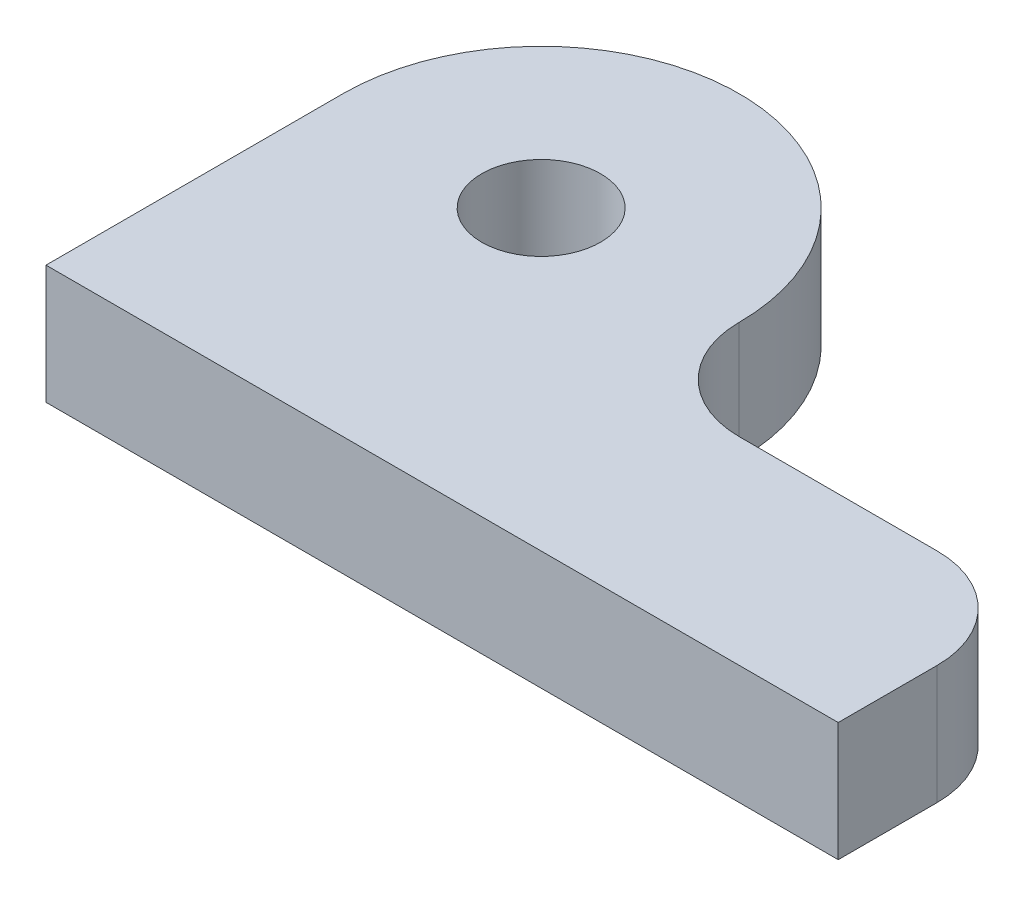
from build123d import *

# Parameters (mm, degrees)
ESQUISSE1_R      = 3
EXTRUSION1_DEPTH = 6


with BuildPart() as part:
    # Esquisse1 → Extrusion1 (new body)
    with BuildSketch(Plane(origin=(0, 0, 0), x_dir=(1, 0, 0), z_dir=(0, 1, 0))):
        with BuildLine():
            Line((25, 10), (35, 10))
            ThreePointArc((35, 10), (38.535533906, 8.535533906), (40, 5))
            Line((40, 5), (40, 0))
            Line((40, 0), (0, 0))
            Line((0, 0), (0, 15))
            ThreePointArc((0, 15), (10, 25), (20, 15))
            ThreePointArc((20, 15), (21.464466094, 11.464466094), (25, 10))
        make_face()
        with Locations(Location((10, 15, 0), (0, 0, 270))):
            Circle(ESQUISSE1_R, mode=Mode.SUBTRACT)
    extrude(amount=EXTRUSION1_DEPTH)


solid = part.part
